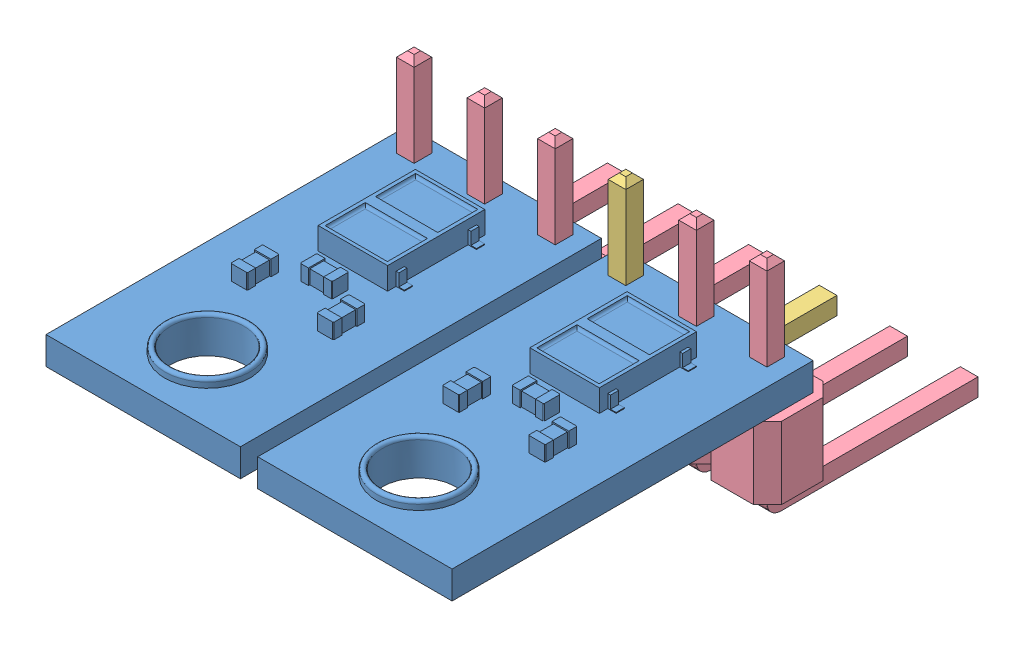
SolidWorks assembly QTR - 1RC x 2 avec header angle.SLDASM, configuration Défaut (file format 11000). Lengths in mm.
Overall size (14.62 7.94 19.76).
10 component instances, 4 part files, 4 mates.
Components (placement in the parent):
- QTR-1RC-1: QTR-1RC.SLDPRT [Predeterminado] at (-0.1808 -0.11 13) size (7 1.8 13)
- QTR-1RC-2: QTR-1RC.SLDPRT [Predeterminado] at (7.4422 -0.11 13) size (7 1.8 13)
- HeaderMale x 6-1: HeaderMale x 6.SLDASM [Predeterminado] at (4.1909 -4.3238 20.12) x (-1 0 0) z (0 1 0) size (2.54 8.73 7.94)
  - pinB-1: pinB.SLDPRT [Predeterminado] at (-1.4403 1.348 1.3) size (2.54 2.5 2.6)
  - pinA-1: pinA.SLDPRT [Predeterminado] at (-0.4878 -7.384 0.1595) size (0.64 7.8 7.94)
  - HeaderMalePart-1: HeaderMalePart.SLDPRT [Predeterminado] at (-2.541 0 0) size (2.54 8.73 7.94)
  - HeaderMalePart-2: HeaderMalePart.SLDPRT [Predeterminado] at (2.541 0 0) size (2.54 8.73 7.94)
  - HeaderMalePart-3: HeaderMalePart.SLDPRT [Predeterminado] at (5.082 0 0) size (2.54 8.73 7.94)
  - HeaderMalePart-4: HeaderMalePart.SLDPRT [Predeterminado] at (-5.082 0 0) size (2.54 8.73 7.94)
  - HeaderMalePart-5: HeaderMalePart.SLDPRT [Predeterminado] at (7.623 0 0) size (2.54 8.73 7.94)
Mates (geometry in assembly coordinates):
- Coïncidente4: coincident: line of QTR-1RC-2 through (9.7616 -0.5103 15.4068) axis (-1 0 0); line of HeaderMale x 6-1/HeaderMalePart-4 through (9.1246 -0.5103 15.4068) axis (1 0 0)
- Coïncidente5: coincident: moEndPointRef_w of QTR-1RC-2; line of HeaderMale x 6-1/HeaderMalePart-4 through (9.1246 -0.4238 20.536) axis (0 0 -1)
- Coïncidente6: coincident: moEndPointRef_w of QTR-1RC-1; line of HeaderMale x 6-1/HeaderMalePart-2 through (1.5016 -0.4238 20.536) axis (0 0 -1)
- Coïncidente7: coincident: line of QTR-1RC-1 through (2.1386 -0.4238 19.9) axis (-1 0 0); line of HeaderMale x 6-1/HeaderMalePart-2 through (1.5016 -0.4238 19.9) axis (1 0 0)
